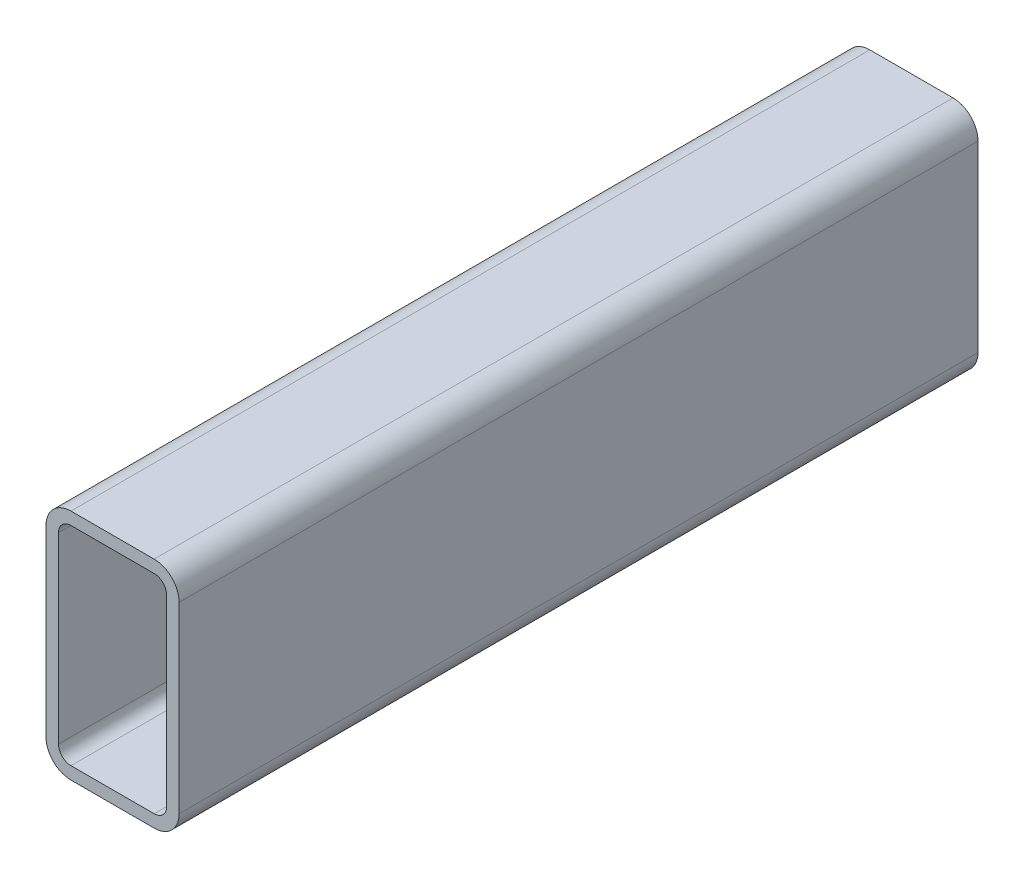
from build123d import *

# Parameters (mm, degrees)
BOSS_EXTRUDE1_DEPTH = 304.8


with BuildPart() as part:
    # Sketch1 → Boss-Extrude1 (new body)
    with BuildSketch(Plane.XY):
        with BuildLine():
            Line((9.525, 88.9), (41.275, 88.9))
            ThreePointArc((41.275, 88.9), (48.010192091, 86.110192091), (50.8, 79.375))
            Line((50.8, 79.375), (50.8, 9.525))
            ThreePointArc((50.8, 9.525), (48.010192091, 2.789807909), (41.275, 0))
            Line((41.275, 0), (9.525, 0))
            ThreePointArc((9.525, 0), (2.789807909, 2.789807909), (0, 9.525))
            Line((0, 9.525), (0, 79.375))
            ThreePointArc((0, 79.375), (2.789807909, 86.110192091), (9.525, 88.9))
        make_face()
        with BuildLine():
            Line((9.525, 84.1375), (41.275, 84.1375))
            ThreePointArc((41.275, 84.1375), (44.642596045, 82.742596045), (46.0375, 79.375))
            Line((46.0375, 79.375), (46.0375, 9.525))
            ThreePointArc((46.0375, 9.525), (44.642596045, 6.157403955), (41.275, 4.7625))
            Line((41.275, 4.7625), (9.525, 4.7625))
            ThreePointArc((9.525, 4.7625), (6.157403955, 6.157403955), (4.7625, 9.525))
            Line((4.7625, 9.525), (4.7625, 79.375))
            ThreePointArc((4.7625, 79.375), (6.157403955, 82.742596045), (9.525, 84.1375))
        make_face(mode=Mode.SUBTRACT)
    extrude(amount=BOSS_EXTRUDE1_DEPTH)


solid = part.part
